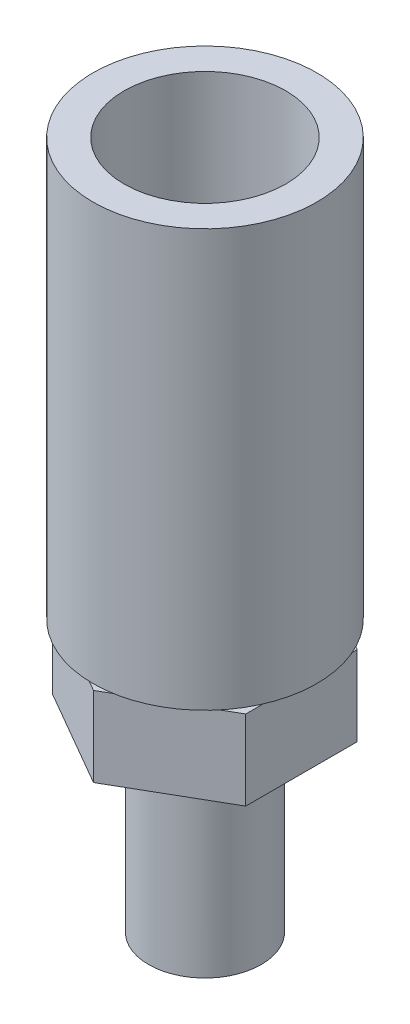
ISO-10303-21;
HEADER;
FILE_DESCRIPTION(('STEP AP214'),'2;1');
FILE_NAME('part.step','',(''),(''),'','','');
FILE_SCHEMA(('AUTOMOTIVE_DESIGN { 1 0 10303 214 1 1 1 1 }'));
ENDSEC;
DATA;
#1=APPLICATION_CONTEXT('core data for automotive mechanical design processes');
#2=APPLICATION_PROTOCOL_DEFINITION('international standard','automotive_design',2000,#1);
#3=PRODUCT_CONTEXT('',#1,'mechanical');
#4=PRODUCT('Part','Part','',(#3));
#5=PRODUCT_RELATED_PRODUCT_CATEGORY('part','',(#4));
#6=PRODUCT_DEFINITION_FORMATION('','',#4);
#7=PRODUCT_DEFINITION_CONTEXT('part definition',#1,'design');
#8=PRODUCT_DEFINITION('design','',#6,#7);
#9=PRODUCT_DEFINITION_SHAPE('','',#8);
#10=(LENGTH_UNIT() NAMED_UNIT(*) SI_UNIT(.MILLI.,.METRE.));
#11=(NAMED_UNIT(*) PLANE_ANGLE_UNIT() SI_UNIT($,.RADIAN.));
#12=(NAMED_UNIT(*) SI_UNIT($,.STERADIAN.) SOLID_ANGLE_UNIT());
#13=UNCERTAINTY_MEASURE_WITH_UNIT(LENGTH_MEASURE(1.E-05),#10,'distance_accuracy_value','');
#14=(GEOMETRIC_REPRESENTATION_CONTEXT(3) GLOBAL_UNCERTAINTY_ASSIGNED_CONTEXT((#13)) GLOBAL_UNIT_ASSIGNED_CONTEXT((#10,
#11,#12)) REPRESENTATION_CONTEXT('',''));
#15=CARTESIAN_POINT('',(0.,0.,0.));
#16=DIRECTION('',(0.,0.,1.));
#17=DIRECTION('',(1.,0.,0.));
#18=AXIS2_PLACEMENT_3D('',#15,#16,#17);
#19=CARTESIAN_POINT('',(8.8011,17.272,0.));
#20=DIRECTION('',(0.,-1.,0.));
#21=DIRECTION('',(1.,0.,0.));
#22=AXIS2_PLACEMENT_3D('',#19,#20,#21);
#23=PLANE('',#22);
#24=CARTESIAN_POINT('',(0.,17.272,0.));
#25=DIRECTION('',(0.,1.,0.));
#26=DIRECTION('',(-1.,0.,0.));
#27=AXIS2_PLACEMENT_3D('',#24,#25,#26);
#28=CIRCLE('',#27,8.8011);
#29=CARTESIAN_POINT('',(-8.8011,17.272,0.));
#30=VERTEX_POINT('',#29);
#31=EDGE_CURVE('E125',#30,#30,#28,.T.);
#32=ORIENTED_EDGE('',*,*,#31,.T.);
#33=EDGE_LOOP('',(#32));
#34=FACE_BOUND('',#33,.T.);
#35=CARTESIAN_POINT('',(0.,17.272,0.));
#36=DIRECTION('',(0.,-1.,0.));
#37=DIRECTION('',(1.,0.,0.));
#38=AXIS2_PLACEMENT_3D('',#35,#36,#37);
#39=CIRCLE('',#38,7.875);
#40=CARTESIAN_POINT('',(7.875,17.272,0.));
#41=VERTEX_POINT('',#40);
#42=EDGE_CURVE('E141',#41,#41,#39,.F.);
#43=ORIENTED_EDGE('',*,*,#42,.F.);
#44=EDGE_LOOP('',(#43));
#45=FACE_BOUND('',#44,.T.);
#46=ADVANCED_FACE('F32',(#34,#45),#23,.F.);
#47=CARTESIAN_POINT('',(0.,0.,0.));
#48=DIRECTION('',(0.,1.,0.));
#49=DIRECTION('',(-1.,0.,0.));
#50=AXIS2_PLACEMENT_3D('',#47,#48,#49);
#51=CYLINDRICAL_SURFACE('',#50,8.8011);
#52=ORIENTED_EDGE('',*,*,#31,.F.);
#53=EDGE_LOOP('',(#52));
#54=FACE_BOUND('',#53,.T.);
#55=CARTESIAN_POINT('',(0.,16.4592,0.));
#56=DIRECTION('',(0.,1.,0.));
#57=DIRECTION('',(-1.,0.,0.));
#58=AXIS2_PLACEMENT_3D('',#55,#56,#57);
#59=CIRCLE('',#58,8.8011);
#60=CARTESIAN_POINT('',(-8.8011,16.4592,0.));
#61=VERTEX_POINT('',#60);
#62=EDGE_CURVE('E227',#61,#61,#59,.T.);
#63=ORIENTED_EDGE('',*,*,#62,.T.);
#64=EDGE_LOOP('',(#63));
#65=FACE_BOUND('',#64,.T.);
#66=ADVANCED_FACE('F256',(#54,#65),#51,.T.);
#67=CARTESIAN_POINT('',(9.398,16.4592,0.));
#68=DIRECTION('',(0.,-1.,0.));
#69=DIRECTION('',(1.,0.,0.));
#70=AXIS2_PLACEMENT_3D('',#67,#68,#69);
#71=PLANE('',#70);
#72=ORIENTED_EDGE('',*,*,#62,.F.);
#73=EDGE_LOOP('',(#72));
#74=FACE_BOUND('',#73,.T.);
#75=CARTESIAN_POINT('',(0.,16.4592,0.));
#76=DIRECTION('',(0.,1.,0.));
#77=DIRECTION('',(-1.,0.,0.));
#78=AXIS2_PLACEMENT_3D('',#75,#76,#77);
#79=CIRCLE('',#78,9.398);
#80=CARTESIAN_POINT('',(-9.398,16.4592,0.));
#81=VERTEX_POINT('',#80);
#82=EDGE_CURVE('E224',#81,#81,#79,.T.);
#83=ORIENTED_EDGE('',*,*,#82,.T.);
#84=EDGE_LOOP('',(#83));
#85=FACE_BOUND('',#84,.T.);
#86=ADVANCED_FACE('F262',(#74,#85),#71,.F.);
#87=CARTESIAN_POINT('',(0.,0.,0.));
#88=DIRECTION('',(0.,1.,0.));
#89=DIRECTION('',(-1.,0.,0.));
#90=AXIS2_PLACEMENT_3D('',#87,#88,#89);
#91=CYLINDRICAL_SURFACE('',#90,9.398);
#92=ORIENTED_EDGE('',*,*,#82,.F.);
#93=EDGE_LOOP('',(#92));
#94=FACE_BOUND('',#93,.T.);
#95=CARTESIAN_POINT('',(0.,14.8844,0.));
#96=DIRECTION('',(0.,1.,0.));
#97=DIRECTION('',(-1.,0.,0.));
#98=AXIS2_PLACEMENT_3D('',#95,#96,#97);
#99=CIRCLE('',#98,9.398);
#100=CARTESIAN_POINT('',(-9.398,14.8844,0.));
#101=VERTEX_POINT('',#100);
#102=EDGE_CURVE('E221',#101,#101,#99,.T.);
#103=ORIENTED_EDGE('',*,*,#102,.T.);
#104=EDGE_LOOP('',(#103));
#105=FACE_BOUND('',#104,.T.);
#106=ADVANCED_FACE('F331',(#94,#105),#91,.T.);
#107=CARTESIAN_POINT('',(8.8011,14.8844,0.));
#108=DIRECTION('',(0.,1.,0.));
#109=DIRECTION('',(-1.,0.,0.));
#110=AXIS2_PLACEMENT_3D('',#107,#108,#109);
#111=PLANE('',#110);
#112=ORIENTED_EDGE('',*,*,#102,.F.);
#113=EDGE_LOOP('',(#112));
#114=FACE_BOUND('',#113,.T.);
#115=CARTESIAN_POINT('',(0.,14.8844,0.));
#116=DIRECTION('',(0.,1.,0.));
#117=DIRECTION('',(-1.,0.,0.));
#118=AXIS2_PLACEMENT_3D('',#115,#116,#117);
#119=CIRCLE('',#118,8.8011);
#120=CARTESIAN_POINT('',(-8.8011,14.8844,0.));
#121=VERTEX_POINT('',#120);
#122=EDGE_CURVE('E218',#121,#121,#119,.T.);
#123=ORIENTED_EDGE('',*,*,#122,.T.);
#124=EDGE_LOOP('',(#123));
#125=FACE_BOUND('',#124,.T.);
#126=ADVANCED_FACE('F339',(#114,#125),#111,.F.);
#127=CARTESIAN_POINT('',(0.,0.,0.));
#128=DIRECTION('',(0.,1.,0.));
#129=DIRECTION('',(-1.,0.,0.));
#130=AXIS2_PLACEMENT_3D('',#127,#128,#129);
#131=CYLINDRICAL_SURFACE('',#130,8.8011);
#132=ORIENTED_EDGE('',*,*,#122,.F.);
#133=EDGE_LOOP('',(#132));
#134=FACE_BOUND('',#133,.T.);
#135=CARTESIAN_POINT('',(0.,13.2334,0.));
#136=DIRECTION('',(0.,1.,0.));
#137=DIRECTION('',(-1.,0.,0.));
#138=AXIS2_PLACEMENT_3D('',#135,#136,#137);
#139=CIRCLE('',#138,8.8011);
#140=CARTESIAN_POINT('',(-8.8011,13.2334,0.));
#141=VERTEX_POINT('',#140);
#142=EDGE_CURVE('E215',#141,#141,#139,.T.);
#143=ORIENTED_EDGE('',*,*,#142,.T.);
#144=EDGE_LOOP('',(#143));
#145=FACE_BOUND('',#144,.T.);
#146=ADVANCED_FACE('F348',(#134,#145),#131,.T.);
#147=CARTESIAN_POINT('',(9.398,13.2334,0.));
#148=DIRECTION('',(0.,-1.,0.));
#149=DIRECTION('',(1.,0.,0.));
#150=AXIS2_PLACEMENT_3D('',#147,#148,#149);
#151=PLANE('',#150);
#152=CARTESIAN_POINT('',(0.,13.2334,0.));
#153=DIRECTION('',(0.,-1.,0.));
#154=DIRECTION('',(1.,0.,0.));
#155=AXIS2_PLACEMENT_3D('',#152,#153,#154);
#156=CIRCLE('',#155,9.0805);
#157=CARTESIAN_POINT('',(9.0805,13.2334,0.));
#158=VERTEX_POINT('',#157);
#159=EDGE_CURVE('E36',#158,#158,#156,.F.);
#160=ORIENTED_EDGE('',*,*,#159,.T.);
#161=EDGE_LOOP('',(#160));
#162=FACE_BOUND('',#161,.T.);
#163=ORIENTED_EDGE('',*,*,#142,.F.);
#164=EDGE_LOOP('',(#163));
#165=FACE_BOUND('',#164,.T.);
#166=ADVANCED_FACE('F357',(#162,#165),#151,.F.);
#167=CARTESIAN_POINT('',(0.,27.682,0.));
#168=DIRECTION('',(0.,-1.,0.));
#169=DIRECTION('',(1.,0.,0.));
#170=AXIS2_PLACEMENT_3D('',#167,#168,#169);
#171=CYLINDRICAL_SURFACE('',#170,7.875);
#172=CARTESIAN_POINT('',(0.,27.682,0.));
#173=DIRECTION('',(0.,1.,0.));
#174=DIRECTION('',(-1.,0.,0.));
#175=AXIS2_PLACEMENT_3D('',#172,#173,#174);
#176=CIRCLE('',#175,7.875);
#177=CARTESIAN_POINT('',(-7.875,27.682,0.));
#178=VERTEX_POINT('',#177);
#179=EDGE_CURVE('E203',#178,#178,#176,.T.);
#180=ORIENTED_EDGE('',*,*,#179,.F.);
#181=EDGE_LOOP('',(#180));
#182=FACE_BOUND('',#181,.T.);
#183=ORIENTED_EDGE('',*,*,#42,.T.);
#184=EDGE_LOOP('',(#183));
#185=FACE_BOUND('',#184,.T.);
#186=ADVANCED_FACE('F367',(#182,#185),#171,.T.);
#187=CARTESIAN_POINT('',(0.,27.682,0.));
#188=DIRECTION('',(0.,1.,0.));
#189=DIRECTION('',(-1.,0.,0.));
#190=AXIS2_PLACEMENT_3D('',#187,#188,#189);
#191=PLANE('',#190);
#192=CARTESIAN_POINT('',(0.,27.682,0.));
#193=DIRECTION('',(0.,1.,0.));
#194=DIRECTION('',(-1.,0.,0.));
#195=AXIS2_PLACEMENT_3D('',#192,#193,#194);
#196=CIRCLE('',#195,0.955);
#197=CARTESIAN_POINT('',(-0.955000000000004,27.682,0.));
#198=VERTEX_POINT('',#197);
#199=EDGE_CURVE('E167',#198,#198,#196,.T.);
#200=ORIENTED_EDGE('',*,*,#199,.F.);
#201=EDGE_LOOP('',(#200));
#202=FACE_BOUND('',#201,.T.);
#203=CARTESIAN_POINT('',(-4.39940905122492,27.682,-2.54000000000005));
#204=DIRECTION('',(0.,1.,0.));
#205=DIRECTION('',(-0.50000000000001,0.,0.866025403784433));
#206=AXIS2_PLACEMENT_3D('',#203,#204,#205);
#207=CIRCLE('',#206,0.955);
#208=CARTESIAN_POINT('',(-4.87690905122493,27.682,-1.71294573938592));
#209=VERTEX_POINT('',#208);
#210=EDGE_CURVE('E173',#209,#209,#207,.T.);
#211=ORIENTED_EDGE('',*,*,#210,.F.);
#212=EDGE_LOOP('',(#211));
#213=FACE_BOUND('',#212,.T.);
#214=CARTESIAN_POINT('',(-4.39940905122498,27.682,2.53999999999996));
#215=DIRECTION('',(0.,1.,0.));
#216=DIRECTION('',(0.499999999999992,0.,0.866025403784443));
#217=AXIS2_PLACEMENT_3D('',#214,#215,#216);
#218=CIRCLE('',#217,0.955);
#219=CARTESIAN_POINT('',(-3.92190905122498,27.682,3.3670542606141));
#220=VERTEX_POINT('',#219);
#221=EDGE_CURVE('E179',#220,#220,#218,.T.);
#222=ORIENTED_EDGE('',*,*,#221,.F.);
#223=EDGE_LOOP('',(#222));
#224=FACE_BOUND('',#223,.T.);
#225=CARTESIAN_POINT('',(4.39940905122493,27.682,2.54000000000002));
#226=DIRECTION('',(0.,1.,0.));
#227=DIRECTION('',(0.500000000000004,0.,-0.866025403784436));
#228=AXIS2_PLACEMENT_3D('',#225,#226,#227);
#229=CIRCLE('',#228,0.955);
#230=CARTESIAN_POINT('',(4.87690905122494,27.682,1.71294573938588));
#231=VERTEX_POINT('',#230);
#232=EDGE_CURVE('E185',#231,#231,#229,.T.);
#233=ORIENTED_EDGE('',*,*,#232,.F.);
#234=EDGE_LOOP('',(#233));
#235=FACE_BOUND('',#234,.T.);
#236=CARTESIAN_POINT('',(4.39940905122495,27.682,-2.53999999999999));
#237=DIRECTION('',(0.,1.,0.));
#238=DIRECTION('',(-0.499999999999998,0.,-0.86602540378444));
#239=AXIS2_PLACEMENT_3D('',#236,#237,#238);
#240=CIRCLE('',#239,0.955);
#241=CARTESIAN_POINT('',(3.92190905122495,27.682,-3.36705426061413));
#242=VERTEX_POINT('',#241);
#243=EDGE_CURVE('E191',#242,#242,#240,.T.);
#244=ORIENTED_EDGE('',*,*,#243,.F.);
#245=EDGE_LOOP('',(#244));
#246=FACE_BOUND('',#245,.T.);
#247=CARTESIAN_POINT('',(0.,27.682,-5.08));
#248=DIRECTION('',(0.,1.,0.));
#249=DIRECTION('',(-1.,0.,0.));
#250=AXIS2_PLACEMENT_3D('',#247,#248,#249);
#251=CIRCLE('',#250,0.955);
#252=CARTESIAN_POINT('',(-0.955000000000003,27.682,-5.08));
#253=VERTEX_POINT('',#252);
#254=EDGE_CURVE('E197',#253,#253,#251,.T.);
#255=ORIENTED_EDGE('',*,*,#254,.F.);
#256=EDGE_LOOP('',(#255));
#257=FACE_BOUND('',#256,.T.);
#258=ORIENTED_EDGE('',*,*,#179,.T.);
#259=EDGE_LOOP('',(#258));
#260=FACE_BOUND('',#259,.T.);
#261=ADVANCED_FACE('F403',(#202,#213,#224,#235,#246,#257,#260),#191,.T.);
#262=CARTESIAN_POINT('',(8.8011,17.272,0.));
#263=DIRECTION('',(0.,-1.,0.));
#264=DIRECTION('',(1.,0.,0.));
#265=AXIS2_PLACEMENT_3D('',#262,#263,#264);
#266=PLANE('',#265);
#267=CARTESIAN_POINT('',(0.,17.272,-5.08));
#268=DIRECTION('',(0.,-1.,0.));
#269=DIRECTION('',(1.,0.,0.));
#270=AXIS2_PLACEMENT_3D('',#267,#268,#269);
#271=CIRCLE('',#270,0.955);
#272=CARTESIAN_POINT('',(0.954999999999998,17.272,-5.08));
#273=VERTEX_POINT('',#272);
#274=EDGE_CURVE('E200',#273,#273,#271,.F.);
#275=ORIENTED_EDGE('',*,*,#274,.T.);
#276=EDGE_LOOP('',(#275));
#277=FACE_BOUND('',#276,.T.);
#278=ADVANCED_FACE('F413',(#277),#266,.F.);
#279=CARTESIAN_POINT('',(0.,14.5708520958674,-5.08));
#280=DIRECTION('',(0.,1.,0.));
#281=DIRECTION('',(-1.,0.,0.));
#282=AXIS2_PLACEMENT_3D('',#279,#280,#281);
#283=CYLINDRICAL_SURFACE('',#282,0.955);
#284=ORIENTED_EDGE('',*,*,#254,.T.);
#285=EDGE_LOOP('',(#284));
#286=FACE_BOUND('',#285,.T.);
#287=ORIENTED_EDGE('',*,*,#274,.F.);
#288=EDGE_LOOP('',(#287));
#289=FACE_BOUND('',#288,.T.);
#290=ADVANCED_FACE('F423',(#286,#289),#283,.F.);
#291=CARTESIAN_POINT('',(8.8011,17.272,0.));
#292=DIRECTION('',(0.,-1.,0.));
#293=DIRECTION('',(1.,0.,0.));
#294=AXIS2_PLACEMENT_3D('',#291,#292,#293);
#295=PLANE('',#294);
#296=CARTESIAN_POINT('',(4.39940905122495,17.272,-2.53999999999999));
#297=DIRECTION('',(0.,-1.,0.));
#298=DIRECTION('',(1.,0.,0.));
#299=AXIS2_PLACEMENT_3D('',#296,#297,#298);
#300=CIRCLE('',#299,0.955);
#301=CARTESIAN_POINT('',(5.35440905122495,17.272,-2.53999999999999));
#302=VERTEX_POINT('',#301);
#303=EDGE_CURVE('E194',#302,#302,#300,.F.);
#304=ORIENTED_EDGE('',*,*,#303,.T.);
#305=EDGE_LOOP('',(#304));
#306=FACE_BOUND('',#305,.T.);
#307=ADVANCED_FACE('F432',(#306),#295,.F.);
#308=CARTESIAN_POINT('',(4.39940905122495,14.5708520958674,-2.53999999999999));
#309=DIRECTION('',(0.,1.,0.));
#310=DIRECTION('',(-1.,0.,0.));
#311=AXIS2_PLACEMENT_3D('',#308,#309,#310);
#312=CYLINDRICAL_SURFACE('',#311,0.955);
#313=ORIENTED_EDGE('',*,*,#243,.T.);
#314=EDGE_LOOP('',(#313));
#315=FACE_BOUND('',#314,.T.);
#316=ORIENTED_EDGE('',*,*,#303,.F.);
#317=EDGE_LOOP('',(#316));
#318=FACE_BOUND('',#317,.T.);
#319=ADVANCED_FACE('F441',(#315,#318),#312,.F.);
#320=CARTESIAN_POINT('',(8.8011,17.272,0.));
#321=DIRECTION('',(0.,-1.,0.));
#322=DIRECTION('',(1.,0.,0.));
#323=AXIS2_PLACEMENT_3D('',#320,#321,#322);
#324=PLANE('',#323);
#325=CARTESIAN_POINT('',(4.39940905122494,17.272,2.54000000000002));
#326=DIRECTION('',(0.,-1.,0.));
#327=DIRECTION('',(1.,0.,0.));
#328=AXIS2_PLACEMENT_3D('',#325,#326,#327);
#329=CIRCLE('',#328,0.955);
#330=CARTESIAN_POINT('',(5.35440905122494,17.272,2.54000000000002));
#331=VERTEX_POINT('',#330);
#332=EDGE_CURVE('E188',#331,#331,#329,.F.);
#333=ORIENTED_EDGE('',*,*,#332,.T.);
#334=EDGE_LOOP('',(#333));
#335=FACE_BOUND('',#334,.T.);
#336=ADVANCED_FACE('F450',(#335),#324,.F.);
#337=CARTESIAN_POINT('',(4.39940905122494,14.5708520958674,2.54000000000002));
#338=DIRECTION('',(0.,1.,0.));
#339=DIRECTION('',(-1.,0.,0.));
#340=AXIS2_PLACEMENT_3D('',#337,#338,#339);
#341=CYLINDRICAL_SURFACE('',#340,0.955);
#342=ORIENTED_EDGE('',*,*,#232,.T.);
#343=EDGE_LOOP('',(#342));
#344=FACE_BOUND('',#343,.T.);
#345=ORIENTED_EDGE('',*,*,#332,.F.);
#346=EDGE_LOOP('',(#345));
#347=FACE_BOUND('',#346,.T.);
#348=ADVANCED_FACE('F459',(#344,#347),#341,.F.);
#349=CARTESIAN_POINT('',(8.8011,17.272,0.));
#350=DIRECTION('',(0.,-1.,0.));
#351=DIRECTION('',(1.,0.,0.));
#352=AXIS2_PLACEMENT_3D('',#349,#350,#351);
#353=PLANE('',#352);
#354=CARTESIAN_POINT('',(-4.39940905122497,17.272,2.53999999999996));
#355=DIRECTION('',(0.,-1.,0.));
#356=DIRECTION('',(1.,0.,0.));
#357=AXIS2_PLACEMENT_3D('',#354,#355,#356);
#358=CIRCLE('',#357,0.955);
#359=CARTESIAN_POINT('',(-3.44440905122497,17.272,2.53999999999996));
#360=VERTEX_POINT('',#359);
#361=EDGE_CURVE('E182',#360,#360,#358,.F.);
#362=ORIENTED_EDGE('',*,*,#361,.T.);
#363=EDGE_LOOP('',(#362));
#364=FACE_BOUND('',#363,.T.);
#365=ADVANCED_FACE('F468',(#364),#353,.F.);
#366=CARTESIAN_POINT('',(-4.39940905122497,14.5708520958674,2.53999999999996));
#367=DIRECTION('',(0.,1.,0.));
#368=DIRECTION('',(-1.,0.,0.));
#369=AXIS2_PLACEMENT_3D('',#366,#367,#368);
#370=CYLINDRICAL_SURFACE('',#369,0.955);
#371=ORIENTED_EDGE('',*,*,#221,.T.);
#372=EDGE_LOOP('',(#371));
#373=FACE_BOUND('',#372,.T.);
#374=ORIENTED_EDGE('',*,*,#361,.F.);
#375=EDGE_LOOP('',(#374));
#376=FACE_BOUND('',#375,.T.);
#377=ADVANCED_FACE('F477',(#373,#376),#370,.F.);
#378=CARTESIAN_POINT('',(8.8011,17.272,0.));
#379=DIRECTION('',(0.,-1.,0.));
#380=DIRECTION('',(1.,0.,0.));
#381=AXIS2_PLACEMENT_3D('',#378,#379,#380);
#382=PLANE('',#381);
#383=CARTESIAN_POINT('',(-4.39940905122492,17.272,-2.54000000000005));
#384=DIRECTION('',(0.,-1.,0.));
#385=DIRECTION('',(1.,0.,0.));
#386=AXIS2_PLACEMENT_3D('',#383,#384,#385);
#387=CIRCLE('',#386,0.955);
#388=CARTESIAN_POINT('',(-3.44440905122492,17.272,-2.54000000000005));
#389=VERTEX_POINT('',#388);
#390=EDGE_CURVE('E176',#389,#389,#387,.F.);
#391=ORIENTED_EDGE('',*,*,#390,.T.);
#392=EDGE_LOOP('',(#391));
#393=FACE_BOUND('',#392,.T.);
#394=ADVANCED_FACE('F486',(#393),#382,.F.);
#395=CARTESIAN_POINT('',(-4.39940905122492,14.5708520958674,-2.54000000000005));
#396=DIRECTION('',(0.,1.,0.));
#397=DIRECTION('',(-1.,0.,0.));
#398=AXIS2_PLACEMENT_3D('',#395,#396,#397);
#399=CYLINDRICAL_SURFACE('',#398,0.955);
#400=ORIENTED_EDGE('',*,*,#210,.T.);
#401=EDGE_LOOP('',(#400));
#402=FACE_BOUND('',#401,.T.);
#403=ORIENTED_EDGE('',*,*,#390,.F.);
#404=EDGE_LOOP('',(#403));
#405=FACE_BOUND('',#404,.T.);
#406=ADVANCED_FACE('F495',(#402,#405),#399,.F.);
#407=CARTESIAN_POINT('',(8.8011,17.272,0.));
#408=DIRECTION('',(0.,-1.,0.));
#409=DIRECTION('',(1.,0.,0.));
#410=AXIS2_PLACEMENT_3D('',#407,#408,#409);
#411=PLANE('',#410);
#412=CARTESIAN_POINT('',(0.,17.272,0.));
#413=DIRECTION('',(0.,-1.,0.));
#414=DIRECTION('',(1.,0.,0.));
#415=AXIS2_PLACEMENT_3D('',#412,#413,#414);
#416=CIRCLE('',#415,0.955);
#417=CARTESIAN_POINT('',(0.954999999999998,17.272,0.));
#418=VERTEX_POINT('',#417);
#419=EDGE_CURVE('E170',#418,#418,#416,.F.);
#420=ORIENTED_EDGE('',*,*,#419,.T.);
#421=EDGE_LOOP('',(#420));
#422=FACE_BOUND('',#421,.T.);
#423=ADVANCED_FACE('F503',(#422),#411,.F.);
#424=CARTESIAN_POINT('',(0.,14.5708520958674,0.));
#425=DIRECTION('',(0.,1.,0.));
#426=DIRECTION('',(-1.,0.,0.));
#427=AXIS2_PLACEMENT_3D('',#424,#425,#426);
#428=CYLINDRICAL_SURFACE('',#427,0.955);
#429=ORIENTED_EDGE('',*,*,#199,.T.);
#430=EDGE_LOOP('',(#429));
#431=FACE_BOUND('',#430,.T.);
#432=ORIENTED_EDGE('',*,*,#419,.F.);
#433=EDGE_LOOP('',(#432));
#434=FACE_BOUND('',#433,.T.);
#435=ADVANCED_FACE('F511',(#431,#434),#428,.F.);
#436=CARTESIAN_POINT('',(0.,0.,0.));
#437=DIRECTION('',(0.,1.,0.));
#438=DIRECTION('',(0.,0.,1.));
#439=AXIS2_PLACEMENT_3D('',#436,#437,#438);
#440=CYLINDRICAL_SURFACE('',#439,9.0805);
#441=CARTESIAN_POINT('',(0.,14.733055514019,0.));
#442=DIRECTION('',(0.,1.,0.));
#443=DIRECTION('',(0.,0.,1.));
#444=AXIS2_PLACEMENT_3D('',#441,#442,#443);
#445=CIRCLE('',#444,9.0805);
#446=CARTESIAN_POINT('',(0.,14.733055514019,9.0805));
#447=VERTEX_POINT('',#446);
#448=EDGE_CURVE('E717',#447,#447,#445,.T.);
#449=ORIENTED_EDGE('',*,*,#448,.T.);
#450=EDGE_LOOP('',(#449));
#451=FACE_BOUND('',#450,.T.);
#452=ORIENTED_EDGE('',*,*,#159,.F.);
#453=EDGE_LOOP('',(#452));
#454=FACE_BOUND('',#453,.T.);
#455=ADVANCED_FACE('F520',(#451,#454),#440,.F.);
#456=CARTESIAN_POINT('',(0.,13.209055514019,9.0805));
#457=DIRECTION('',(0.,-1.,0.));
#458=DIRECTION('',(0.,0.,-1.));
#459=AXIS2_PLACEMENT_3D('',#456,#457,#458);
#460=PLANE('',#459);
#461=CARTESIAN_POINT('',(0.,13.209055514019,0.));
#462=DIRECTION('',(0.,1.,0.));
#463=DIRECTION('',(0.,0.,1.));
#464=AXIS2_PLACEMENT_3D('',#461,#462,#463);
#465=CIRCLE('',#464,10.56888956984);
#466=CARTESIAN_POINT('',(0.,13.209055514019,10.56888956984));
#467=VERTEX_POINT('',#466);
#468=EDGE_CURVE('E714',#467,#467,#465,.T.);
#469=ORIENTED_EDGE('',*,*,#468,.F.);
#470=EDGE_LOOP('',(#469));
#471=FACE_BOUND('',#470,.T.);
#472=CARTESIAN_POINT('',(0.,13.209055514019,0.));
#473=DIRECTION('',(0.,-1.,0.));
#474=DIRECTION('',(0.,0.,-1.));
#475=AXIS2_PLACEMENT_3D('',#472,#473,#474);
#476=CIRCLE('',#475,9.398);
#477=CARTESIAN_POINT('',(0.,13.209055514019,-9.398));
#478=VERTEX_POINT('',#477);
#479=EDGE_CURVE('E148',#478,#478,#476,.T.);
#480=ORIENTED_EDGE('',*,*,#479,.F.);
#481=EDGE_LOOP('',(#480));
#482=FACE_BOUND('',#481,.T.);
#483=ADVANCED_FACE('F566',(#471,#482),#460,.T.);
#484=CARTESIAN_POINT('',(0.,8.48465551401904,9.0805));
#485=DIRECTION('',(0.,-1.,0.));
#486=DIRECTION('',(0.,0.,-1.));
#487=AXIS2_PLACEMENT_3D('',#484,#485,#486);
#488=PLANE('',#487);
#489=CARTESIAN_POINT('',(0.,8.48465551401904,0.));
#490=DIRECTION('',(0.,1.,0.));
#491=DIRECTION('',(0.,0.,1.));
#492=AXIS2_PLACEMENT_3D('',#489,#490,#491);
#493=CIRCLE('',#492,9.0805);
#494=CARTESIAN_POINT('',(0.,8.48465551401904,9.0805));
#495=VERTEX_POINT('',#494);
#496=EDGE_CURVE('E707',#495,#495,#493,.T.);
#497=ORIENTED_EDGE('',*,*,#496,.T.);
#498=EDGE_LOOP('',(#497));
#499=FACE_BOUND('',#498,.T.);
#500=CARTESIAN_POINT('',(0.,8.48465551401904,0.));
#501=DIRECTION('',(0.,1.,0.));
#502=DIRECTION('',(0.,0.,1.));
#503=AXIS2_PLACEMENT_3D('',#500,#501,#502);
#504=CIRCLE('',#503,11.049);
#505=CARTESIAN_POINT('',(0.,8.48465551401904,11.049));
#506=VERTEX_POINT('',#505);
#507=EDGE_CURVE('E150',#506,#506,#504,.T.);
#508=ORIENTED_EDGE('',*,*,#507,.F.);
#509=EDGE_LOOP('',(#508));
#510=FACE_BOUND('',#509,.T.);
#511=ADVANCED_FACE('F575',(#499,#510),#488,.T.);
#512=CARTESIAN_POINT('',(0.,0.,0.));
#513=DIRECTION('',(0.,1.,0.));
#514=DIRECTION('',(0.,0.,1.));
#515=AXIS2_PLACEMENT_3D('',#512,#513,#514);
#516=CYLINDRICAL_SURFACE('',#515,11.049);
#517=ORIENTED_EDGE('',*,*,#507,.T.);
#518=EDGE_LOOP('',(#517));
#519=FACE_BOUND('',#518,.T.);
#520=CARTESIAN_POINT('',(0.,49.632655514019,0.));
#521=DIRECTION('',(0.,1.,0.));
#522=DIRECTION('',(0.,0.,1.));
#523=AXIS2_PLACEMENT_3D('',#520,#521,#522);
#524=CIRCLE('',#523,11.049);
#525=CARTESIAN_POINT('',(0.,49.632655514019,11.049));
#526=VERTEX_POINT('',#525);
#527=EDGE_CURVE('E156',#526,#526,#524,.T.);
#528=ORIENTED_EDGE('',*,*,#527,.F.);
#529=EDGE_LOOP('',(#528));
#530=FACE_BOUND('',#529,.T.);
#531=ADVANCED_FACE('F584',(#519,#530),#516,.T.);
#532=CARTESIAN_POINT('',(0.,49.632655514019,11.049));
#533=DIRECTION('',(0.,1.,0.));
#534=DIRECTION('',(0.,0.,1.));
#535=AXIS2_PLACEMENT_3D('',#532,#533,#534);
#536=PLANE('',#535);
#537=ORIENTED_EDGE('',*,*,#527,.T.);
#538=EDGE_LOOP('',(#537));
#539=FACE_BOUND('',#538,.T.);
#540=CARTESIAN_POINT('',(0.,49.632655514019,0.));
#541=DIRECTION('',(0.,1.,0.));
#542=DIRECTION('',(0.,0.,1.));
#543=AXIS2_PLACEMENT_3D('',#540,#541,#542);
#544=CIRCLE('',#543,7.9756);
#545=CARTESIAN_POINT('',(0.,49.632655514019,7.9756));
#546=VERTEX_POINT('',#545);
#547=EDGE_CURVE('E161',#546,#546,#544,.T.);
#548=ORIENTED_EDGE('',*,*,#547,.F.);
#549=EDGE_LOOP('',(#548));
#550=FACE_BOUND('',#549,.T.);
#551=ADVANCED_FACE('F593',(#539,#550),#536,.T.);
#552=CARTESIAN_POINT('',(0.,0.,0.));
#553=DIRECTION('',(0.,1.,0.));
#554=DIRECTION('',(0.,0.,1.));
#555=AXIS2_PLACEMENT_3D('',#552,#553,#554);
#556=CYLINDRICAL_SURFACE('',#555,7.9756);
#557=ORIENTED_EDGE('',*,*,#547,.T.);
#558=EDGE_LOOP('',(#557));
#559=FACE_BOUND('',#558,.T.);
#560=CARTESIAN_POINT('',(0.,18.906198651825,0.));
#561=DIRECTION('',(0.,1.,0.));
#562=DIRECTION('',(0.,0.,1.));
#563=AXIS2_PLACEMENT_3D('',#560,#561,#562);
#564=CIRCLE('',#563,7.9756);
#565=CARTESIAN_POINT('',(0.,18.906198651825,7.9756));
#566=VERTEX_POINT('',#565);
#567=EDGE_CURVE('E726',#566,#566,#564,.T.);
#568=ORIENTED_EDGE('',*,*,#567,.F.);
#569=EDGE_LOOP('',(#568));
#570=FACE_BOUND('',#569,.T.);
#571=ADVANCED_FACE('F601',(#559,#570),#556,.F.);
#572=CARTESIAN_POINT('',(0.,18.906198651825,7.9756));
#573=DIRECTION('',(0.,-1.,0.));
#574=DIRECTION('',(0.,0.,-1.));
#575=AXIS2_PLACEMENT_3D('',#572,#573,#574);
#576=PLANE('',#575);
#577=ORIENTED_EDGE('',*,*,#567,.T.);
#578=EDGE_LOOP('',(#577));
#579=FACE_BOUND('',#578,.T.);
#580=CARTESIAN_POINT('',(0.,18.906198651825,0.));
#581=DIRECTION('',(0.,1.,0.));
#582=DIRECTION('',(0.,0.,1.));
#583=AXIS2_PLACEMENT_3D('',#580,#581,#582);
#584=CIRCLE('',#583,10.56888956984);
#585=CARTESIAN_POINT('',(0.,18.906198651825,10.56888956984));
#586=VERTEX_POINT('',#585);
#587=EDGE_CURVE('E723',#586,#586,#584,.T.);
#588=ORIENTED_EDGE('',*,*,#587,.F.);
#589=EDGE_LOOP('',(#588));
#590=FACE_BOUND('',#589,.T.);
#591=ADVANCED_FACE('F610',(#579,#590),#576,.T.);
#592=CARTESIAN_POINT('',(0.,0.,0.));
#593=DIRECTION('',(0.,1.,0.));
#594=DIRECTION('',(0.,0.,1.));
#595=AXIS2_PLACEMENT_3D('',#592,#593,#594);
#596=CYLINDRICAL_SURFACE('',#595,10.56888956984);
#597=ORIENTED_EDGE('',*,*,#587,.T.);
#598=EDGE_LOOP('',(#597));
#599=FACE_BOUND('',#598,.T.);
#600=CARTESIAN_POINT('',(0.,14.733055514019,0.));
#601=DIRECTION('',(0.,1.,0.));
#602=DIRECTION('',(0.,0.,1.));
#603=AXIS2_PLACEMENT_3D('',#600,#601,#602);
#604=CIRCLE('',#603,10.56888956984);
#605=CARTESIAN_POINT('',(0.,14.733055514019,10.56888956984));
#606=VERTEX_POINT('',#605);
#607=EDGE_CURVE('E720',#606,#606,#604,.T.);
#608=ORIENTED_EDGE('',*,*,#607,.F.);
#609=EDGE_LOOP('',(#608));
#610=FACE_BOUND('',#609,.T.);
#611=ADVANCED_FACE('F619',(#599,#610),#596,.F.);
#612=CARTESIAN_POINT('',(0.,14.733055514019,10.56888956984));
#613=DIRECTION('',(0.,1.,0.));
#614=DIRECTION('',(0.,0.,1.));
#615=AXIS2_PLACEMENT_3D('',#612,#613,#614);
#616=PLANE('',#615);
#617=ORIENTED_EDGE('',*,*,#607,.T.);
#618=EDGE_LOOP('',(#617));
#619=FACE_BOUND('',#618,.T.);
#620=ORIENTED_EDGE('',*,*,#448,.F.);
#621=EDGE_LOOP('',(#620));
#622=FACE_BOUND('',#621,.T.);
#623=ADVANCED_FACE('F628',(#619,#622),#616,.T.);
#624=CARTESIAN_POINT('',(0.,0.,0.));
#625=DIRECTION('',(0.,1.,0.));
#626=DIRECTION('',(0.,0.,1.));
#627=AXIS2_PLACEMENT_3D('',#624,#625,#626);
#628=CYLINDRICAL_SURFACE('',#627,10.56888956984);
#629=ORIENTED_EDGE('',*,*,#468,.T.);
#630=EDGE_LOOP('',(#629));
#631=FACE_BOUND('',#630,.T.);
#632=CARTESIAN_POINT('',(0.,11.558055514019,0.));
#633=DIRECTION('',(0.,1.,0.));
#634=DIRECTION('',(0.,0.,1.));
#635=AXIS2_PLACEMENT_3D('',#632,#633,#634);
#636=CIRCLE('',#635,10.56888956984);
#637=CARTESIAN_POINT('',(0.,11.558055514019,10.56888956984));
#638=VERTEX_POINT('',#637);
#639=EDGE_CURVE('E709',#638,#638,#636,.T.);
#640=ORIENTED_EDGE('',*,*,#639,.F.);
#641=EDGE_LOOP('',(#640));
#642=FACE_BOUND('',#641,.T.);
#643=ADVANCED_FACE('F637',(#631,#642),#628,.F.);
#644=CARTESIAN_POINT('',(0.,11.558055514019,10.56888956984));
#645=DIRECTION('',(0.,1.,0.));
#646=DIRECTION('',(0.,0.,1.));
#647=AXIS2_PLACEMENT_3D('',#644,#645,#646);
#648=PLANE('',#647);
#649=ORIENTED_EDGE('',*,*,#639,.T.);
#650=EDGE_LOOP('',(#649));
#651=FACE_BOUND('',#650,.T.);
#652=CARTESIAN_POINT('',(0.,11.558055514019,0.));
#653=DIRECTION('',(0.,1.,0.));
#654=DIRECTION('',(0.,0.,1.));
#655=AXIS2_PLACEMENT_3D('',#652,#653,#654);
#656=CIRCLE('',#655,9.0805);
#657=CARTESIAN_POINT('',(0.,11.558055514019,9.0805));
#658=VERTEX_POINT('',#657);
#659=EDGE_CURVE('E704',#658,#658,#656,.T.);
#660=ORIENTED_EDGE('',*,*,#659,.F.);
#661=EDGE_LOOP('',(#660));
#662=FACE_BOUND('',#661,.T.);
#663=ADVANCED_FACE('F646',(#651,#662),#648,.T.);
#664=CARTESIAN_POINT('',(0.,0.,0.));
#665=DIRECTION('',(0.,1.,0.));
#666=DIRECTION('',(0.,0.,1.));
#667=AXIS2_PLACEMENT_3D('',#664,#665,#666);
#668=CYLINDRICAL_SURFACE('',#667,9.0805);
#669=ORIENTED_EDGE('',*,*,#659,.T.);
#670=EDGE_LOOP('',(#669));
#671=FACE_BOUND('',#670,.T.);
#672=ORIENTED_EDGE('',*,*,#496,.F.);
#673=EDGE_LOOP('',(#672));
#674=FACE_BOUND('',#673,.T.);
#675=ADVANCED_FACE('F539',(#671,#674),#668,.F.);
#676=CARTESIAN_POINT('',(0.,-18.280303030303,0.));
#677=DIRECTION('',(0.,-1.,0.));
#678=DIRECTION('',(0.,0.,-1.));
#679=AXIS2_PLACEMENT_3D('',#676,#677,#678);
#680=PLANE('',#679);
#681=CARTESIAN_POINT('',(0.,-18.280303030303,0.));
#682=DIRECTION('',(0.,-1.,0.));
#683=DIRECTION('',(0.,0.,-1.));
#684=AXIS2_PLACEMENT_3D('',#681,#682,#683);
#685=CIRCLE('',#684,5.55625);
#686=CARTESIAN_POINT('',(0.,-18.280303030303,-5.55625));
#687=VERTEX_POINT('',#686);
#688=EDGE_CURVE('E154',#687,#687,#685,.T.);
#689=ORIENTED_EDGE('',*,*,#688,.T.);
#690=EDGE_LOOP('',(#689));
#691=FACE_BOUND('',#690,.T.);
#692=ADVANCED_FACE('F530',(#691),#680,.T.);
#693=CARTESIAN_POINT('',(0.,-18.280303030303,0.));
#694=DIRECTION('',(0.,1.,0.));
#695=DIRECTION('',(0.,0.,1.));
#696=AXIS2_PLACEMENT_3D('',#693,#694,#695);
#697=CYLINDRICAL_SURFACE('',#696,5.55625);
#698=ORIENTED_EDGE('',*,*,#688,.F.);
#699=EDGE_LOOP('',(#698));
#700=FACE_BOUND('',#699,.T.);
#701=CARTESIAN_POINT('',(0.,0.,0.));
#702=DIRECTION('',(0.,1.,0.));
#703=DIRECTION('',(0.,0.,1.));
#704=AXIS2_PLACEMENT_3D('',#701,#702,#703);
#705=CIRCLE('',#704,5.55625);
#706=CARTESIAN_POINT('',(0.,0.,5.55625));
#707=VERTEX_POINT('',#706);
#708=EDGE_CURVE('E144',#707,#707,#705,.F.);
#709=ORIENTED_EDGE('',*,*,#708,.T.);
#710=EDGE_LOOP('',(#709));
#711=FACE_BOUND('',#710,.T.);
#712=ADVANCED_FACE('F525',(#700,#711),#697,.T.);
#713=CARTESIAN_POINT('',(-9.52499999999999,0.,-16.4977839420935));
#714=DIRECTION('',(0.,1.,0.));
#715=DIRECTION('',(0.,0.,1.));
#716=AXIS2_PLACEMENT_3D('',#713,#714,#715);
#717=PLANE('',#716);
#718=ORIENTED_EDGE('',*,*,#708,.F.);
#719=EDGE_LOOP('',(#718));
#720=FACE_BOUND('',#719,.T.);
#721=CARTESIAN_POINT('',(0.,0.,0.));
#722=DIRECTION('',(0.,-1.,0.));
#723=DIRECTION('',(0.,0.,-1.));
#724=AXIS2_PLACEMENT_3D('',#721,#722,#723);
#725=CIRCLE('',#724,6.25663579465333);
#726=CARTESIAN_POINT('',(0.,0.,-6.25663579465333));
#727=VERTEX_POINT('',#726);
#728=EDGE_CURVE('E42',#727,#727,#725,.F.);
#729=ORIENTED_EDGE('',*,*,#728,.F.);
#730=EDGE_LOOP('',(#729));
#731=FACE_BOUND('',#730,.T.);
#732=ADVANCED_FACE('F254',(#720,#731),#717,.F.);
#733=CARTESIAN_POINT('',(0.,0.284318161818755,0.));
#734=DIRECTION('',(0.,1.,0.));
#735=DIRECTION('',(-1.,0.,0.));
#736=AXIS2_PLACEMENT_3D('',#733,#734,#735);
#737=TOROIDAL_SURFACE('',#736,7.1,0.89);
#738=ORIENTED_EDGE('',*,*,#728,.T.);
#739=EDGE_LOOP('',(#738));
#740=FACE_BOUND('',#739,.T.);
#741=CARTESIAN_POINT('',(0.,0.,0.));
#742=DIRECTION('',(0.,1.,0.));
#743=DIRECTION('',(0.,0.,1.));
#744=AXIS2_PLACEMENT_3D('',#741,#742,#743);
#745=CIRCLE('',#744,7.94336420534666);
#746=CARTESIAN_POINT('',(0.,0.,7.94336420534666));
#747=VERTEX_POINT('',#746);
#748=EDGE_CURVE('E11',#747,#747,#745,.F.);
#749=ORIENTED_EDGE('',*,*,#748,.T.);
#750=EDGE_LOOP('',(#749));
#751=FACE_BOUND('',#750,.T.);
#752=ADVANCED_FACE('F252',(#740,#751),#737,.T.);
#753=DIRECTION('',(-0.866025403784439,0.,-0.5));
#754=VECTOR('',#753,1.);
#755=CARTESIAN_POINT('',(9.52499999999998,0.,-5.4992613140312));
#756=LINE('',#755,#754);
#757=CARTESIAN_POINT('',(9.52499999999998,0.,-5.4992613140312));
#758=VERTEX_POINT('',#757);
#759=CARTESIAN_POINT('',(0.,0.,-10.9985226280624));
#760=VERTEX_POINT('',#759);
#761=EDGE_CURVE('E121',#758,#760,#756,.T.);
#762=ORIENTED_EDGE('',*,*,#761,.F.);
#763=DIRECTION('',(0.,0.,-1.));
#764=VECTOR('',#763,1.);
#765=CARTESIAN_POINT('',(9.52499999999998,0.,5.49926131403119));
#766=LINE('',#765,#764);
#767=CARTESIAN_POINT('',(9.52499999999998,0.,5.49926131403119));
#768=VERTEX_POINT('',#767);
#769=EDGE_CURVE('E80',#768,#758,#766,.T.);
#770=ORIENTED_EDGE('',*,*,#769,.F.);
#771=DIRECTION('',(0.866025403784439,0.,-0.5));
#772=VECTOR('',#771,1.);
#773=CARTESIAN_POINT('',(0.,0.,10.9985226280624));
#774=LINE('',#773,#772);
#775=CARTESIAN_POINT('',(0.,0.,10.9985226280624));
#776=VERTEX_POINT('',#775);
#777=EDGE_CURVE('E74',#776,#768,#774,.T.);
#778=ORIENTED_EDGE('',*,*,#777,.F.);
#779=DIRECTION('',(0.866025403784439,0.,0.5));
#780=VECTOR('',#779,1.);
#781=CARTESIAN_POINT('',(-9.52499999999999,0.,5.49926131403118));
#782=LINE('',#781,#780);
#783=CARTESIAN_POINT('',(-9.52499999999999,0.,5.49926131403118));
#784=VERTEX_POINT('',#783);
#785=EDGE_CURVE('E111',#784,#776,#782,.T.);
#786=ORIENTED_EDGE('',*,*,#785,.F.);
#787=DIRECTION('',(0.,0.,1.));
#788=VECTOR('',#787,1.);
#789=CARTESIAN_POINT('',(-9.52499999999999,0.,-5.49926131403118));
#790=LINE('',#789,#788);
#791=CARTESIAN_POINT('',(-9.52499999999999,0.,-5.49926131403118));
#792=VERTEX_POINT('',#791);
#793=EDGE_CURVE('E127',#792,#784,#790,.T.);
#794=ORIENTED_EDGE('',*,*,#793,.F.);
#795=DIRECTION('',(-0.866025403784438,0.,0.5));
#796=VECTOR('',#795,1.);
#797=CARTESIAN_POINT('',(0.,0.,-10.9985226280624));
#798=LINE('',#797,#796);
#799=EDGE_CURVE('E124',#760,#792,#798,.T.);
#800=ORIENTED_EDGE('',*,*,#799,.F.);
#801=EDGE_LOOP('',(#762,#770,#778,#786,#794,#800));
#802=FACE_BOUND('',#801,.T.);
#803=ORIENTED_EDGE('',*,*,#748,.F.);
#804=EDGE_LOOP('',(#803));
#805=FACE_BOUND('',#804,.T.);
#806=ADVANCED_FACE('F241',(#802,#805),#717,.F.);
#807=CARTESIAN_POINT('',(9.52499999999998,7.874,5.49926131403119));
#808=DIRECTION('',(-1.,0.,0.));
#809=DIRECTION('',(0.,0.,1.));
#810=AXIS2_PLACEMENT_3D('',#807,#808,#809);
#811=PLANE('',#810);
#812=ORIENTED_EDGE('',*,*,#769,.T.);
#813=DIRECTION('',(0.,-1.,0.));
#814=VECTOR('',#813,1.);
#815=CARTESIAN_POINT('',(9.52499999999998,7.874,-5.4992613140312));
#816=LINE('',#815,#814);
#817=CARTESIAN_POINT('',(9.52499999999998,7.874,-5.4992613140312));
#818=VERTEX_POINT('',#817);
#819=EDGE_CURVE('E117',#818,#758,#816,.T.);
#820=ORIENTED_EDGE('',*,*,#819,.F.);
#821=DIRECTION('',(0.,0.,-1.));
#822=VECTOR('',#821,1.);
#823=CARTESIAN_POINT('',(9.52499999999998,7.874,5.49926131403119));
#824=LINE('',#823,#822);
#825=CARTESIAN_POINT('',(9.52499999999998,7.874,5.49926131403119));
#826=VERTEX_POINT('',#825);
#827=EDGE_CURVE('E51',#826,#818,#824,.T.);
#828=ORIENTED_EDGE('',*,*,#827,.F.);
#829=DIRECTION('',(0.,-1.,0.));
#830=VECTOR('',#829,1.);
#831=CARTESIAN_POINT('',(9.52499999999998,7.874,5.49926131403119));
#832=LINE('',#831,#830);
#833=EDGE_CURVE('E113',#826,#768,#832,.T.);
#834=ORIENTED_EDGE('',*,*,#833,.T.);
#835=EDGE_LOOP('',(#812,#820,#828,#834));
#836=FACE_BOUND('',#835,.T.);
#837=ADVANCED_FACE('F244',(#836),#811,.F.);
#838=CARTESIAN_POINT('',(0.,7.874,10.9985226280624));
#839=DIRECTION('',(-0.5,0.,-0.866025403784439));
#840=DIRECTION('',(-0.866025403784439,0.,0.5));
#841=AXIS2_PLACEMENT_3D('',#838,#839,#840);
#842=PLANE('',#841);
#843=ORIENTED_EDGE('',*,*,#777,.T.);
#844=ORIENTED_EDGE('',*,*,#833,.F.);
#845=DIRECTION('',(0.866025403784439,0.,-0.5));
#846=VECTOR('',#845,1.);
#847=CARTESIAN_POINT('',(0.,7.874,10.9985226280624));
#848=LINE('',#847,#846);
#849=CARTESIAN_POINT('',(0.,7.874,10.9985226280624));
#850=VERTEX_POINT('',#849);
#851=EDGE_CURVE('E101',#850,#826,#848,.T.);
#852=ORIENTED_EDGE('',*,*,#851,.F.);
#853=DIRECTION('',(0.,-1.,0.));
#854=VECTOR('',#853,1.);
#855=CARTESIAN_POINT('',(0.,7.874,10.9985226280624));
#856=LINE('',#855,#854);
#857=EDGE_CURVE('E108',#850,#776,#856,.T.);
#858=ORIENTED_EDGE('',*,*,#857,.T.);
#859=EDGE_LOOP('',(#843,#844,#852,#858));
#860=FACE_BOUND('',#859,.T.);
#861=ADVANCED_FACE('F115',(#860),#842,.F.);
#862=CARTESIAN_POINT('',(-9.52499999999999,7.874,5.49926131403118));
#863=DIRECTION('',(0.5,0.,-0.866025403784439));
#864=DIRECTION('',(-0.866025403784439,0.,-0.5));
#865=AXIS2_PLACEMENT_3D('',#862,#863,#864);
#866=PLANE('',#865);
#867=ORIENTED_EDGE('',*,*,#785,.T.);
#868=ORIENTED_EDGE('',*,*,#857,.F.);
#869=DIRECTION('',(0.866025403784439,0.,0.5));
#870=VECTOR('',#869,1.);
#871=CARTESIAN_POINT('',(-9.52499999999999,7.874,5.49926131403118));
#872=LINE('',#871,#870);
#873=CARTESIAN_POINT('',(-9.52499999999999,7.874,5.49926131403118));
#874=VERTEX_POINT('',#873);
#875=EDGE_CURVE('E96',#874,#850,#872,.T.);
#876=ORIENTED_EDGE('',*,*,#875,.F.);
#877=DIRECTION('',(0.,-1.,0.));
#878=VECTOR('',#877,1.);
#879=CARTESIAN_POINT('',(-9.52499999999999,7.874,5.49926131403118));
#880=LINE('',#879,#878);
#881=EDGE_CURVE('E112',#874,#784,#880,.T.);
#882=ORIENTED_EDGE('',*,*,#881,.T.);
#883=EDGE_LOOP('',(#867,#868,#876,#882));
#884=FACE_BOUND('',#883,.T.);
#885=ADVANCED_FACE('F109',(#884),#866,.F.);
#886=CARTESIAN_POINT('',(-9.52499999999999,7.874,-5.49926131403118));
#887=DIRECTION('',(1.,0.,0.));
#888=DIRECTION('',(0.,0.,-1.));
#889=AXIS2_PLACEMENT_3D('',#886,#887,#888);
#890=PLANE('',#889);
#891=ORIENTED_EDGE('',*,*,#793,.T.);
#892=ORIENTED_EDGE('',*,*,#881,.F.);
#893=DIRECTION('',(0.,0.,1.));
#894=VECTOR('',#893,1.);
#895=CARTESIAN_POINT('',(-9.52499999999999,7.874,-5.49926131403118));
#896=LINE('',#895,#894);
#897=CARTESIAN_POINT('',(-9.52499999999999,7.874,-5.49926131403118));
#898=VERTEX_POINT('',#897);
#899=EDGE_CURVE('E103',#898,#874,#896,.T.);
#900=ORIENTED_EDGE('',*,*,#899,.F.);
#901=DIRECTION('',(0.,-1.,0.));
#902=VECTOR('',#901,1.);
#903=CARTESIAN_POINT('',(-9.52499999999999,7.874,-5.49926131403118));
#904=LINE('',#903,#902);
#905=EDGE_CURVE('E136',#898,#792,#904,.T.);
#906=ORIENTED_EDGE('',*,*,#905,.T.);
#907=EDGE_LOOP('',(#891,#892,#900,#906));
#908=FACE_BOUND('',#907,.T.);
#909=ADVANCED_FACE('F238',(#908),#890,.F.);
#910=CARTESIAN_POINT('',(0.,7.874,-10.9985226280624));
#911=DIRECTION('',(0.5,0.,0.866025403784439));
#912=DIRECTION('',(0.866025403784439,0.,-0.5));
#913=AXIS2_PLACEMENT_3D('',#910,#911,#912);
#914=PLANE('',#913);
#915=ORIENTED_EDGE('',*,*,#799,.T.);
#916=ORIENTED_EDGE('',*,*,#905,.F.);
#917=DIRECTION('',(-0.866025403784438,0.,0.5));
#918=VECTOR('',#917,1.);
#919=CARTESIAN_POINT('',(0.,7.874,-10.9985226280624));
#920=LINE('',#919,#918);
#921=CARTESIAN_POINT('',(0.,7.874,-10.9985226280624));
#922=VERTEX_POINT('',#921);
#923=EDGE_CURVE('E89',#922,#898,#920,.T.);
#924=ORIENTED_EDGE('',*,*,#923,.F.);
#925=DIRECTION('',(0.,-1.,0.));
#926=VECTOR('',#925,1.);
#927=CARTESIAN_POINT('',(0.,7.874,-10.9985226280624));
#928=LINE('',#927,#926);
#929=EDGE_CURVE('E139',#922,#760,#928,.T.);
#930=ORIENTED_EDGE('',*,*,#929,.T.);
#931=EDGE_LOOP('',(#915,#916,#924,#930));
#932=FACE_BOUND('',#931,.T.);
#933=ADVANCED_FACE('F235',(#932),#914,.F.);
#934=CARTESIAN_POINT('',(9.52499999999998,7.874,-5.4992613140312));
#935=DIRECTION('',(-0.5,0.,0.866025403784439));
#936=DIRECTION('',(0.866025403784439,0.,0.5));
#937=AXIS2_PLACEMENT_3D('',#934,#935,#936);
#938=PLANE('',#937);
#939=ORIENTED_EDGE('',*,*,#761,.T.);
#940=ORIENTED_EDGE('',*,*,#929,.F.);
#941=DIRECTION('',(-0.866025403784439,0.,-0.5));
#942=VECTOR('',#941,1.);
#943=CARTESIAN_POINT('',(9.52499999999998,7.874,-5.4992613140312));
#944=LINE('',#943,#942);
#945=EDGE_CURVE('E132',#818,#922,#944,.T.);
#946=ORIENTED_EDGE('',*,*,#945,.F.);
#947=ORIENTED_EDGE('',*,*,#819,.T.);
#948=EDGE_LOOP('',(#939,#940,#946,#947));
#949=FACE_BOUND('',#948,.T.);
#950=ADVANCED_FACE('F34',(#949),#938,.F.);
#951=CARTESIAN_POINT('',(-9.52499999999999,7.874,-16.4977839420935));
#952=DIRECTION('',(0.,1.,0.));
#953=DIRECTION('',(0.,0.,1.));
#954=AXIS2_PLACEMENT_3D('',#951,#952,#953);
#955=PLANE('',#954);
#956=ORIENTED_EDGE('',*,*,#945,.T.);
#957=ORIENTED_EDGE('',*,*,#923,.T.);
#958=ORIENTED_EDGE('',*,*,#899,.T.);
#959=ORIENTED_EDGE('',*,*,#875,.T.);
#960=ORIENTED_EDGE('',*,*,#851,.T.);
#961=ORIENTED_EDGE('',*,*,#827,.T.);
#962=EDGE_LOOP('',(#956,#957,#958,#959,#960,#961));
#963=FACE_BOUND('',#962,.T.);
#964=CARTESIAN_POINT('',(0.,7.874,0.));
#965=DIRECTION('',(0.,1.,0.));
#966=DIRECTION('',(-1.,0.,0.));
#967=AXIS2_PLACEMENT_3D('',#964,#965,#966);
#968=CIRCLE('',#967,8.8011);
#969=CARTESIAN_POINT('',(-8.8011,7.874,0.));
#970=VERTEX_POINT('',#969);
#971=EDGE_CURVE('E206',#970,#970,#968,.T.);
#972=ORIENTED_EDGE('',*,*,#971,.F.);
#973=EDGE_LOOP('',(#972));
#974=FACE_BOUND('',#973,.T.);
#975=ADVANCED_FACE('F98',(#963,#974),#955,.T.);
#976=CARTESIAN_POINT('',(0.,0.,0.));
#977=DIRECTION('',(0.,1.,0.));
#978=DIRECTION('',(-1.,0.,0.));
#979=AXIS2_PLACEMENT_3D('',#976,#977,#978);
#980=CYLINDRICAL_SURFACE('',#979,8.8011);
#981=CARTESIAN_POINT('',(0.,11.6586,0.));
#982=DIRECTION('',(0.,1.,0.));
#983=DIRECTION('',(-1.,0.,0.));
#984=AXIS2_PLACEMENT_3D('',#981,#982,#983);
#985=CIRCLE('',#984,8.8011);
#986=CARTESIAN_POINT('',(-8.8011,11.6586,0.));
#987=VERTEX_POINT('',#986);
#988=EDGE_CURVE('E209',#987,#987,#985,.T.);
#989=ORIENTED_EDGE('',*,*,#988,.F.);
#990=EDGE_LOOP('',(#989));
#991=FACE_BOUND('',#990,.T.);
#992=ORIENTED_EDGE('',*,*,#971,.T.);
#993=EDGE_LOOP('',(#992));
#994=FACE_BOUND('',#993,.T.);
#995=ADVANCED_FACE('F269',(#991,#994),#980,.T.);
#996=CARTESIAN_POINT('',(8.80109999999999,11.6586,0.));
#997=DIRECTION('',(0.,1.,0.));
#998=DIRECTION('',(-1.,0.,0.));
#999=AXIS2_PLACEMENT_3D('',#996,#997,#998);
#1000=PLANE('',#999);
#1001=CARTESIAN_POINT('',(0.,11.6586,0.));
#1002=DIRECTION('',(0.,1.,0.));
#1003=DIRECTION('',(-1.,0.,0.));
#1004=AXIS2_PLACEMENT_3D('',#1001,#1002,#1003);
#1005=CIRCLE('',#1004,9.398);
#1006=CARTESIAN_POINT('',(-9.398,11.6586,0.));
#1007=VERTEX_POINT('',#1006);
#1008=EDGE_CURVE('E212',#1007,#1007,#1005,.T.);
#1009=ORIENTED_EDGE('',*,*,#1008,.F.);
#1010=EDGE_LOOP('',(#1009));
#1011=FACE_BOUND('',#1010,.T.);
#1012=ORIENTED_EDGE('',*,*,#988,.T.);
#1013=EDGE_LOOP('',(#1012));
#1014=FACE_BOUND('',#1013,.T.);
#1015=ADVANCED_FACE('F274',(#1011,#1014),#1000,.F.);
#1016=CARTESIAN_POINT('',(0.,0.,0.));
#1017=DIRECTION('',(0.,1.,0.));
#1018=DIRECTION('',(-1.,0.,0.));
#1019=AXIS2_PLACEMENT_3D('',#1016,#1017,#1018);
#1020=CYLINDRICAL_SURFACE('',#1019,9.398);
#1021=ORIENTED_EDGE('',*,*,#479,.T.);
#1022=EDGE_LOOP('',(#1021));
#1023=FACE_BOUND('',#1022,.T.);
#1024=ORIENTED_EDGE('',*,*,#1008,.T.);
#1025=EDGE_LOOP('',(#1024));
#1026=FACE_BOUND('',#1025,.T.);
#1027=ADVANCED_FACE('F373',(#1023,#1026),#1020,.T.);
#1028=CLOSED_SHELL('',(#46,#66,#86,#106,#126,#146,#166,#186,#261,#278,#290,#307,#319,#336,#348,
#365,#377,#394,#406,#423,#435,#455,#483,#511,#531,#551,#571,#591,#611,#623,#643,#663,#675,#692,
#712,#732,#752,#806,#837,#861,#885,#909,#933,#950,#975,#995,#1015,#1027));
#1029=MANIFOLD_SOLID_BREP('B2',#1028);
#1030=ADVANCED_BREP_SHAPE_REPRESENTATION('',(#18,#1029),#14);
#1031=SHAPE_DEFINITION_REPRESENTATION(#9,#1030);
ENDSEC;
END-ISO-10303-21;
